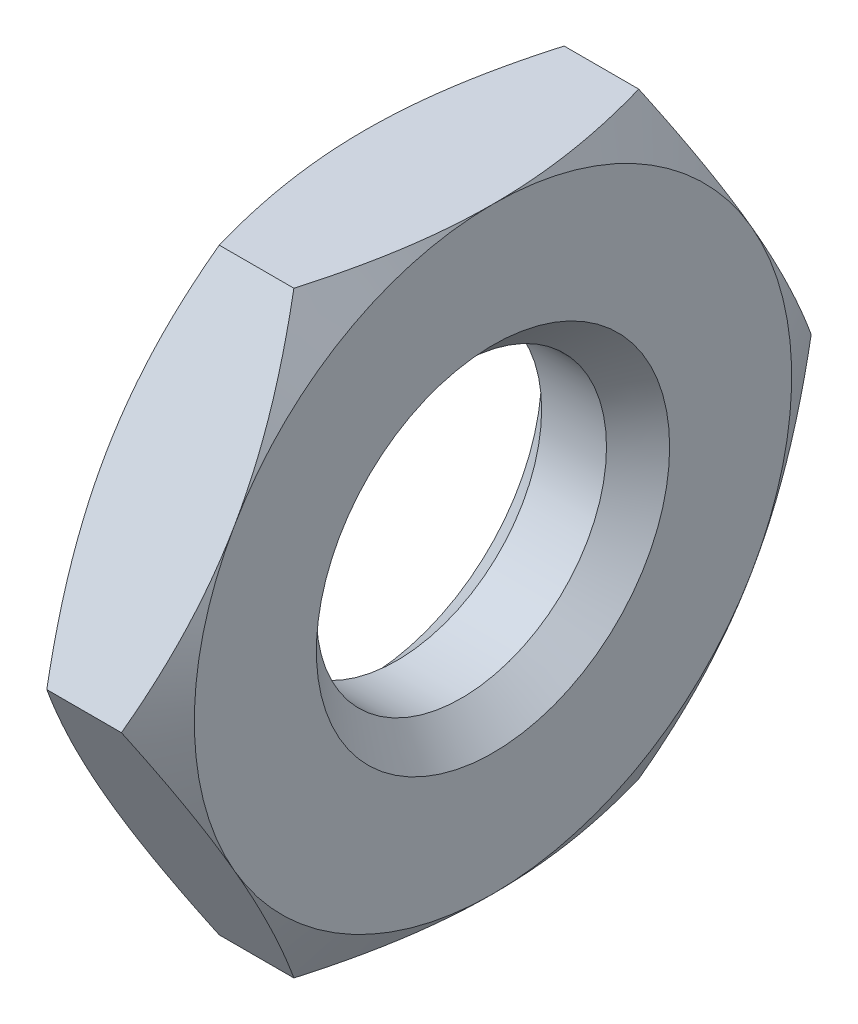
from build123d import *

# Parameters (mm, degrees)
SKETCH1_R      = 0.85
EXTRUDE1_DEPTH = 0.75
CHAMFER1_SIZE  = 0.185


with BuildPart() as part:
    # Sketch1 → Extrude1 (new body)
    with BuildSketch(Plane(origin=(0, 0, 0), x_dir=(0, 0, -1), z_dir=(1, 0, 0))):
        Polygon((1.010362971, 1.75), (-1.010362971, 1.75), (-2.020725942, 0), (-1.010362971, -1.75), (1.010362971, -1.75), (2.020725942, 0), align=None)
        Circle(SKETCH1_R, mode=Mode.SUBTRACT)
    extrude(amount=EXTRUDE1_DEPTH)

    # Sketch2 → Cut-Revolve1 (revolve, cut)
    with BuildSketch(Plane.XY):
        Polygon((0.75, 1.75), (0.75, 7), (0, 7), (0, 1.75), (0.375, 2.399519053), align=None)
    revolve(axis=Axis((0.75, 0, 0), (-1, 0, 0)), mode=Mode.SUBTRACT)

    # Chamfer1
    chamfer1_edges = [part.edges().sort_by_distance(p)[0] for p in [
        (0, 0, 0.85),
        (0.75, 0, 0.85),
    ]]
    chamfer(chamfer1_edges, length=CHAMFER1_SIZE)


solid = part.part
